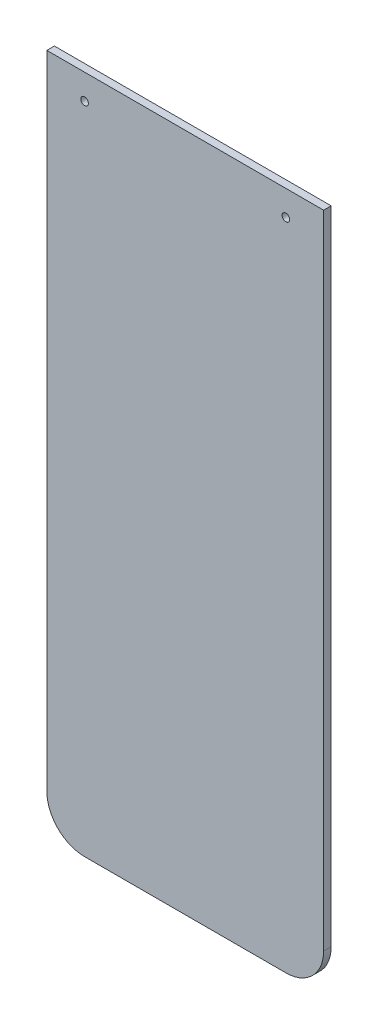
ISO-10303-21;
HEADER;
FILE_DESCRIPTION(('STEP AP214'),'2;1');
FILE_NAME('part.step','',(''),(''),'','','');
FILE_SCHEMA(('AUTOMOTIVE_DESIGN { 1 0 10303 214 1 1 1 1 }'));
ENDSEC;
DATA;
#1=APPLICATION_CONTEXT('core data for automotive mechanical design processes');
#2=APPLICATION_PROTOCOL_DEFINITION('international standard','automotive_design',2000,#1);
#3=PRODUCT_CONTEXT('',#1,'mechanical');
#4=PRODUCT('Part','Part','',(#3));
#5=PRODUCT_RELATED_PRODUCT_CATEGORY('part','',(#4));
#6=PRODUCT_DEFINITION_FORMATION('','',#4);
#7=PRODUCT_DEFINITION_CONTEXT('part definition',#1,'design');
#8=PRODUCT_DEFINITION('design','',#6,#7);
#9=PRODUCT_DEFINITION_SHAPE('','',#8);
#10=(LENGTH_UNIT() NAMED_UNIT(*) SI_UNIT(.MILLI.,.METRE.));
#11=(NAMED_UNIT(*) PLANE_ANGLE_UNIT() SI_UNIT($,.RADIAN.));
#12=(NAMED_UNIT(*) SI_UNIT($,.STERADIAN.) SOLID_ANGLE_UNIT());
#13=UNCERTAINTY_MEASURE_WITH_UNIT(LENGTH_MEASURE(1.E-05),#10,'distance_accuracy_value','');
#14=(GEOMETRIC_REPRESENTATION_CONTEXT(3) GLOBAL_UNCERTAINTY_ASSIGNED_CONTEXT((#13)) GLOBAL_UNIT_ASSIGNED_CONTEXT((#10,
#11,#12)) REPRESENTATION_CONTEXT('',''));
#15=CARTESIAN_POINT('',(0.,0.,0.));
#16=DIRECTION('',(0.,0.,1.));
#17=DIRECTION('',(1.,0.,0.));
#18=AXIS2_PLACEMENT_3D('',#15,#16,#17);
#19=CARTESIAN_POINT('',(0.,0.,3.));
#20=DIRECTION('',(0.,0.,1.));
#21=DIRECTION('',(1.,0.,0.));
#22=AXIS2_PLACEMENT_3D('',#19,#20,#21);
#23=PLANE('',#22);
#24=CARTESIAN_POINT('',(40.,-234.,3.));
#25=DIRECTION('',(0.,0.,1.));
#26=DIRECTION('',(1.,0.,0.));
#27=AXIS2_PLACEMENT_3D('',#24,#25,#26);
#28=CIRCLE('',#27,1.5);
#29=CARTESIAN_POINT('',(41.5,-234.,3.));
#30=VERTEX_POINT('',#29);
#31=EDGE_CURVE('E116',#30,#30,#28,.T.);
#32=ORIENTED_EDGE('',*,*,#31,.F.);
#33=EDGE_LOOP('',(#32));
#34=FACE_BOUND('',#33,.T.);
#35=DIRECTION('',(0.,-1.,0.));
#36=VECTOR('',#35,1.);
#37=CARTESIAN_POINT('',(-55.,-224.,3.));
#38=LINE('',#37,#36);
#39=CARTESIAN_POINT('',(-55.,-224.,3.));
#40=VERTEX_POINT('',#39);
#41=CARTESIAN_POINT('',(-55.,-479.,3.));
#42=VERTEX_POINT('',#41);
#43=EDGE_CURVE('E121',#40,#42,#38,.T.);
#44=ORIENTED_EDGE('',*,*,#43,.T.);
#45=CARTESIAN_POINT('',(-40.,-479.,3.));
#46=DIRECTION('',(0.,0.,1.));
#47=DIRECTION('',(1.,0.,0.));
#48=AXIS2_PLACEMENT_3D('',#45,#46,#47);
#49=CIRCLE('',#48,15.);
#50=CARTESIAN_POINT('',(-40.,-494.,3.));
#51=VERTEX_POINT('',#50);
#52=EDGE_CURVE('E42',#42,#51,#49,.T.);
#53=ORIENTED_EDGE('',*,*,#52,.T.);
#54=DIRECTION('',(1.,0.,0.));
#55=VECTOR('',#54,1.);
#56=CARTESIAN_POINT('',(-55.,-494.,3.));
#57=LINE('',#56,#55);
#58=CARTESIAN_POINT('',(40.,-494.,3.));
#59=VERTEX_POINT('',#58);
#60=EDGE_CURVE('E95',#51,#59,#57,.T.);
#61=ORIENTED_EDGE('',*,*,#60,.T.);
#62=CARTESIAN_POINT('',(40.,-479.,3.));
#63=DIRECTION('',(0.,0.,1.));
#64=DIRECTION('',(1.,0.,0.));
#65=AXIS2_PLACEMENT_3D('',#62,#63,#64);
#66=CIRCLE('',#65,15.);
#67=CARTESIAN_POINT('',(55.,-479.,3.));
#68=VERTEX_POINT('',#67);
#69=EDGE_CURVE('E49',#59,#68,#66,.T.);
#70=ORIENTED_EDGE('',*,*,#69,.T.);
#71=DIRECTION('',(0.,1.,0.));
#72=VECTOR('',#71,1.);
#73=CARTESIAN_POINT('',(55.,-224.,3.));
#74=LINE('',#73,#72);
#75=CARTESIAN_POINT('',(55.,-224.,3.));
#76=VERTEX_POINT('',#75);
#77=EDGE_CURVE('E87',#68,#76,#74,.T.);
#78=ORIENTED_EDGE('',*,*,#77,.T.);
#79=DIRECTION('',(-1.,0.,0.));
#80=VECTOR('',#79,1.);
#81=CARTESIAN_POINT('',(-55.,-224.,3.));
#82=LINE('',#81,#80);
#83=EDGE_CURVE('E91',#76,#40,#82,.T.);
#84=ORIENTED_EDGE('',*,*,#83,.T.);
#85=EDGE_LOOP('',(#44,#53,#61,#70,#78,#84));
#86=FACE_BOUND('',#85,.T.);
#87=CARTESIAN_POINT('',(-40.,-234.,3.));
#88=DIRECTION('',(0.,0.,1.));
#89=DIRECTION('',(1.,0.,0.));
#90=AXIS2_PLACEMENT_3D('',#87,#88,#89);
#91=CIRCLE('',#90,1.5);
#92=CARTESIAN_POINT('',(-38.5,-234.,3.));
#93=VERTEX_POINT('',#92);
#94=EDGE_CURVE('E151',#93,#93,#91,.T.);
#95=ORIENTED_EDGE('',*,*,#94,.F.);
#96=EDGE_LOOP('',(#95));
#97=FACE_BOUND('',#96,.T.);
#98=ADVANCED_FACE('F34',(#34,#86,#97),#23,.T.);
#99=CARTESIAN_POINT('',(0.,0.,0.));
#100=DIRECTION('',(0.,0.,1.));
#101=DIRECTION('',(1.,0.,0.));
#102=AXIS2_PLACEMENT_3D('',#99,#100,#101);
#103=PLANE('',#102);
#104=DIRECTION('',(1.,0.,0.));
#105=VECTOR('',#104,1.);
#106=CARTESIAN_POINT('',(-55.,-494.,0.));
#107=LINE('',#106,#105);
#108=CARTESIAN_POINT('',(-40.,-494.,0.));
#109=VERTEX_POINT('',#108);
#110=CARTESIAN_POINT('',(40.,-494.,0.));
#111=VERTEX_POINT('',#110);
#112=EDGE_CURVE('E115',#109,#111,#107,.T.);
#113=ORIENTED_EDGE('',*,*,#112,.F.);
#114=CARTESIAN_POINT('',(-40.,-479.,0.));
#115=DIRECTION('',(0.,0.,1.));
#116=DIRECTION('',(1.,0.,0.));
#117=AXIS2_PLACEMENT_3D('',#114,#115,#116);
#118=CIRCLE('',#117,15.);
#119=CARTESIAN_POINT('',(-55.,-479.,0.));
#120=VERTEX_POINT('',#119);
#121=EDGE_CURVE('E129',#109,#120,#118,.F.);
#122=ORIENTED_EDGE('',*,*,#121,.T.);
#123=DIRECTION('',(0.,-1.,0.));
#124=VECTOR('',#123,1.);
#125=CARTESIAN_POINT('',(-55.,-224.,0.));
#126=LINE('',#125,#124);
#127=CARTESIAN_POINT('',(-55.,-224.,0.));
#128=VERTEX_POINT('',#127);
#129=EDGE_CURVE('E113',#128,#120,#126,.T.);
#130=ORIENTED_EDGE('',*,*,#129,.F.);
#131=DIRECTION('',(-1.,0.,0.));
#132=VECTOR('',#131,1.);
#133=CARTESIAN_POINT('',(-55.,-224.,0.));
#134=LINE('',#133,#132);
#135=CARTESIAN_POINT('',(55.,-224.,0.));
#136=VERTEX_POINT('',#135);
#137=EDGE_CURVE('E120',#136,#128,#134,.T.);
#138=ORIENTED_EDGE('',*,*,#137,.F.);
#139=DIRECTION('',(0.,1.,0.));
#140=VECTOR('',#139,1.);
#141=CARTESIAN_POINT('',(55.,-224.,0.));
#142=LINE('',#141,#140);
#143=CARTESIAN_POINT('',(55.,-479.,0.));
#144=VERTEX_POINT('',#143);
#145=EDGE_CURVE('E101',#144,#136,#142,.T.);
#146=ORIENTED_EDGE('',*,*,#145,.F.);
#147=CARTESIAN_POINT('',(40.,-479.,0.));
#148=DIRECTION('',(0.,0.,1.));
#149=DIRECTION('',(1.,0.,0.));
#150=AXIS2_PLACEMENT_3D('',#147,#148,#149);
#151=CIRCLE('',#150,15.);
#152=EDGE_CURVE('E127',#144,#111,#151,.F.);
#153=ORIENTED_EDGE('',*,*,#152,.T.);
#154=EDGE_LOOP('',(#113,#122,#130,#138,#146,#153));
#155=FACE_BOUND('',#154,.T.);
#156=CARTESIAN_POINT('',(40.,-234.,0.));
#157=DIRECTION('',(0.,0.,1.));
#158=DIRECTION('',(1.,0.,0.));
#159=AXIS2_PLACEMENT_3D('',#156,#157,#158);
#160=CIRCLE('',#159,1.5);
#161=CARTESIAN_POINT('',(41.5,-234.,0.));
#162=VERTEX_POINT('',#161);
#163=EDGE_CURVE('E148',#162,#162,#160,.T.);
#164=ORIENTED_EDGE('',*,*,#163,.T.);
#165=EDGE_LOOP('',(#164));
#166=FACE_BOUND('',#165,.T.);
#167=CARTESIAN_POINT('',(-40.,-234.,0.));
#168=DIRECTION('',(0.,0.,1.));
#169=DIRECTION('',(1.,0.,0.));
#170=AXIS2_PLACEMENT_3D('',#167,#168,#169);
#171=CIRCLE('',#170,1.5);
#172=CARTESIAN_POINT('',(-38.5,-234.,0.));
#173=VERTEX_POINT('',#172);
#174=EDGE_CURVE('E154',#173,#173,#171,.T.);
#175=ORIENTED_EDGE('',*,*,#174,.T.);
#176=EDGE_LOOP('',(#175));
#177=FACE_BOUND('',#176,.T.);
#178=ADVANCED_FACE('F143',(#155,#166,#177),#103,.F.);
#179=CARTESIAN_POINT('',(-55.,-224.,3.));
#180=DIRECTION('',(1.,0.,0.));
#181=DIRECTION('',(0.,1.,0.));
#182=AXIS2_PLACEMENT_3D('',#179,#180,#181);
#183=PLANE('',#182);
#184=ORIENTED_EDGE('',*,*,#129,.T.);
#185=DIRECTION('',(0.,0.,-1.));
#186=VECTOR('',#185,1.);
#187=CARTESIAN_POINT('',(-55.,-479.,3.));
#188=LINE('',#187,#186);
#189=EDGE_CURVE('E57',#120,#42,#188,.F.);
#190=ORIENTED_EDGE('',*,*,#189,.T.);
#191=ORIENTED_EDGE('',*,*,#43,.F.);
#192=DIRECTION('',(0.,0.,-1.));
#193=VECTOR('',#192,1.);
#194=CARTESIAN_POINT('',(-55.,-224.,3.));
#195=LINE('',#194,#193);
#196=EDGE_CURVE('E105',#40,#128,#195,.T.);
#197=ORIENTED_EDGE('',*,*,#196,.T.);
#198=EDGE_LOOP('',(#184,#190,#191,#197));
#199=FACE_BOUND('',#198,.T.);
#200=ADVANCED_FACE('F145',(#199),#183,.F.);
#201=CARTESIAN_POINT('',(-55.,-494.,3.));
#202=DIRECTION('',(0.,1.,0.));
#203=DIRECTION('',(0.,0.,1.));
#204=AXIS2_PLACEMENT_3D('',#201,#202,#203);
#205=PLANE('',#204);
#206=ORIENTED_EDGE('',*,*,#60,.F.);
#207=DIRECTION('',(0.,0.,-1.));
#208=VECTOR('',#207,1.);
#209=CARTESIAN_POINT('',(-40.,-494.,3.));
#210=LINE('',#209,#208);
#211=EDGE_CURVE('E124',#51,#109,#210,.T.);
#212=ORIENTED_EDGE('',*,*,#211,.T.);
#213=ORIENTED_EDGE('',*,*,#112,.T.);
#214=DIRECTION('',(0.,0.,-1.));
#215=VECTOR('',#214,1.);
#216=CARTESIAN_POINT('',(40.,-494.,3.));
#217=LINE('',#216,#215);
#218=EDGE_CURVE('E104',#111,#59,#217,.F.);
#219=ORIENTED_EDGE('',*,*,#218,.T.);
#220=EDGE_LOOP('',(#206,#212,#213,#219));
#221=FACE_BOUND('',#220,.T.);
#222=ADVANCED_FACE('F137',(#221),#205,.F.);
#223=CARTESIAN_POINT('',(55.,-224.,3.));
#224=DIRECTION('',(-1.,0.,0.));
#225=DIRECTION('',(0.,-1.,0.));
#226=AXIS2_PLACEMENT_3D('',#223,#224,#225);
#227=PLANE('',#226);
#228=ORIENTED_EDGE('',*,*,#77,.F.);
#229=DIRECTION('',(0.,0.,-1.));
#230=VECTOR('',#229,1.);
#231=CARTESIAN_POINT('',(55.,-479.,3.));
#232=LINE('',#231,#230);
#233=EDGE_CURVE('E11',#68,#144,#232,.T.);
#234=ORIENTED_EDGE('',*,*,#233,.T.);
#235=ORIENTED_EDGE('',*,*,#145,.T.);
#236=DIRECTION('',(0.,0.,-1.));
#237=VECTOR('',#236,1.);
#238=CARTESIAN_POINT('',(55.,-224.,3.));
#239=LINE('',#238,#237);
#240=EDGE_CURVE('E98',#76,#136,#239,.T.);
#241=ORIENTED_EDGE('',*,*,#240,.F.);
#242=EDGE_LOOP('',(#228,#234,#235,#241));
#243=FACE_BOUND('',#242,.T.);
#244=ADVANCED_FACE('F99',(#243),#227,.F.);
#245=CARTESIAN_POINT('',(-55.,-224.,3.));
#246=DIRECTION('',(0.,-1.,0.));
#247=DIRECTION('',(1.,0.,0.));
#248=AXIS2_PLACEMENT_3D('',#245,#246,#247);
#249=PLANE('',#248);
#250=ORIENTED_EDGE('',*,*,#137,.T.);
#251=ORIENTED_EDGE('',*,*,#196,.F.);
#252=ORIENTED_EDGE('',*,*,#83,.F.);
#253=ORIENTED_EDGE('',*,*,#240,.T.);
#254=EDGE_LOOP('',(#250,#251,#252,#253));
#255=FACE_BOUND('',#254,.T.);
#256=ADVANCED_FACE('F107',(#255),#249,.F.);
#257=CARTESIAN_POINT('',(40.,-234.,3.));
#258=DIRECTION('',(0.,0.,-1.));
#259=DIRECTION('',(-1.,0.,0.));
#260=AXIS2_PLACEMENT_3D('',#257,#258,#259);
#261=CYLINDRICAL_SURFACE('',#260,1.5);
#262=ORIENTED_EDGE('',*,*,#31,.T.);
#263=EDGE_LOOP('',(#262));
#264=FACE_BOUND('',#263,.T.);
#265=ORIENTED_EDGE('',*,*,#163,.F.);
#266=EDGE_LOOP('',(#265));
#267=FACE_BOUND('',#266,.T.);
#268=ADVANCED_FACE('F172',(#264,#267),#261,.F.);
#269=CARTESIAN_POINT('',(-40.,-234.,3.));
#270=DIRECTION('',(0.,0.,-1.));
#271=DIRECTION('',(-1.,0.,0.));
#272=AXIS2_PLACEMENT_3D('',#269,#270,#271);
#273=CYLINDRICAL_SURFACE('',#272,1.5);
#274=ORIENTED_EDGE('',*,*,#94,.T.);
#275=EDGE_LOOP('',(#274));
#276=FACE_BOUND('',#275,.T.);
#277=ORIENTED_EDGE('',*,*,#174,.F.);
#278=EDGE_LOOP('',(#277));
#279=FACE_BOUND('',#278,.T.);
#280=ADVANCED_FACE('F160',(#276,#279),#273,.F.);
#281=CARTESIAN_POINT('',(-40.,-479.,3.));
#282=DIRECTION('',(0.,0.,-1.));
#283=DIRECTION('',(-1.,0.,0.));
#284=AXIS2_PLACEMENT_3D('',#281,#282,#283);
#285=CYLINDRICAL_SURFACE('',#284,15.);
#286=ORIENTED_EDGE('',*,*,#52,.F.);
#287=ORIENTED_EDGE('',*,*,#189,.F.);
#288=ORIENTED_EDGE('',*,*,#121,.F.);
#289=ORIENTED_EDGE('',*,*,#211,.F.);
#290=EDGE_LOOP('',(#286,#287,#288,#289));
#291=FACE_BOUND('',#290,.T.);
#292=ADVANCED_FACE('F140',(#291),#285,.T.);
#293=CARTESIAN_POINT('',(40.,-479.,3.));
#294=DIRECTION('',(0.,0.,-1.));
#295=DIRECTION('',(-1.,0.,0.));
#296=AXIS2_PLACEMENT_3D('',#293,#294,#295);
#297=CYLINDRICAL_SURFACE('',#296,15.);
#298=ORIENTED_EDGE('',*,*,#69,.F.);
#299=ORIENTED_EDGE('',*,*,#218,.F.);
#300=ORIENTED_EDGE('',*,*,#152,.F.);
#301=ORIENTED_EDGE('',*,*,#233,.F.);
#302=EDGE_LOOP('',(#298,#299,#300,#301));
#303=FACE_BOUND('',#302,.T.);
#304=ADVANCED_FACE('F36',(#303),#297,.T.);
#305=CLOSED_SHELL('',(#98,#178,#200,#222,#244,#256,#268,#280,#292,#304));
#306=MANIFOLD_SOLID_BREP('B2',#305);
#307=ADVANCED_BREP_SHAPE_REPRESENTATION('',(#18,#306),#14);
#308=SHAPE_DEFINITION_REPRESENTATION(#9,#307);
ENDSEC;
END-ISO-10303-21;
